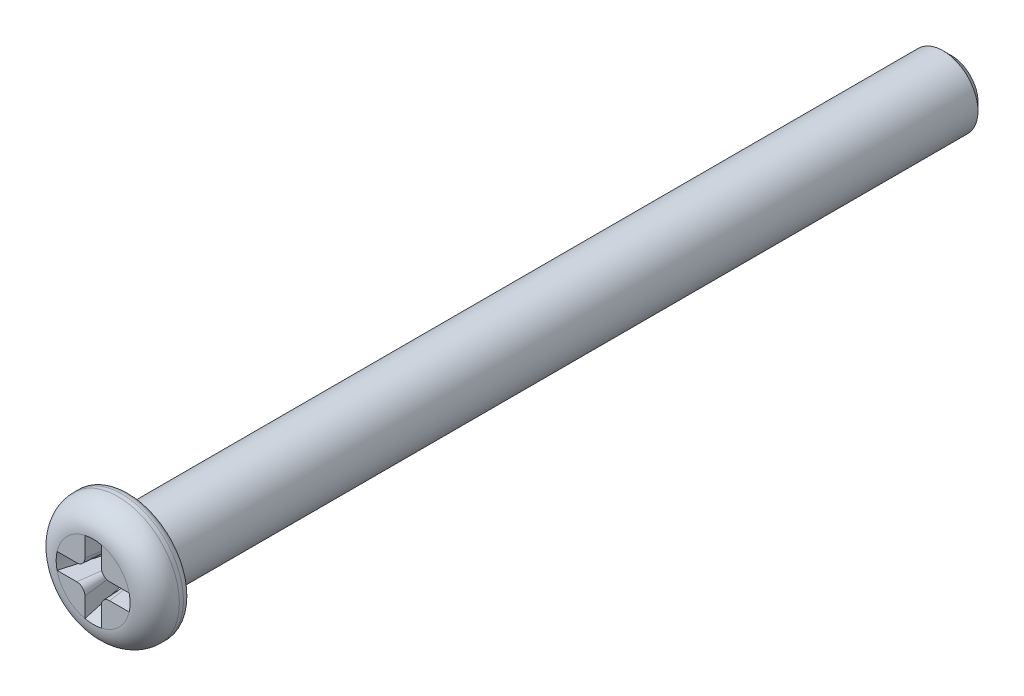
ISO-10303-21;
HEADER;
FILE_DESCRIPTION(('STEP AP214'),'2;1');
FILE_NAME('part.step','',(''),(''),'','','');
FILE_SCHEMA(('AUTOMOTIVE_DESIGN { 1 0 10303 214 1 1 1 1 }'));
ENDSEC;
DATA;
#1=APPLICATION_CONTEXT('core data for automotive mechanical design processes');
#2=APPLICATION_PROTOCOL_DEFINITION('international standard','automotive_design',2000,#1);
#3=PRODUCT_CONTEXT('',#1,'mechanical');
#4=PRODUCT('Part','Part','',(#3));
#5=PRODUCT_RELATED_PRODUCT_CATEGORY('part','',(#4));
#6=PRODUCT_DEFINITION_FORMATION('','',#4);
#7=PRODUCT_DEFINITION_CONTEXT('part definition',#1,'design');
#8=PRODUCT_DEFINITION('design','',#6,#7);
#9=PRODUCT_DEFINITION_SHAPE('','',#8);
#10=(LENGTH_UNIT() NAMED_UNIT(*) SI_UNIT(.MILLI.,.METRE.));
#11=(NAMED_UNIT(*) PLANE_ANGLE_UNIT() SI_UNIT($,.RADIAN.));
#12=(NAMED_UNIT(*) SI_UNIT($,.STERADIAN.) SOLID_ANGLE_UNIT());
#13=UNCERTAINTY_MEASURE_WITH_UNIT(LENGTH_MEASURE(1.E-05),#10,'distance_accuracy_value','');
#14=(GEOMETRIC_REPRESENTATION_CONTEXT(3) GLOBAL_UNCERTAINTY_ASSIGNED_CONTEXT((#13)) GLOBAL_UNIT_ASSIGNED_CONTEXT((#10,
#11,#12)) REPRESENTATION_CONTEXT('',''));
#15=CARTESIAN_POINT('',(0.,0.,0.));
#16=DIRECTION('',(0.,0.,1.));
#17=DIRECTION('',(1.,0.,0.));
#18=AXIS2_PLACEMENT_3D('',#15,#16,#17);
#19=CARTESIAN_POINT('',(40.6000000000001,6.39999999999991,4.9));
#20=DIRECTION('',(1.,0.,0.));
#21=DIRECTION('',(0.,1.,0.));
#22=AXIS2_PLACEMENT_3D('',#19,#20,#21);
#23=PLANE('',#22);
#24=DIRECTION('',(0.,1.,0.));
#25=VECTOR('',#24,1.);
#26=CARTESIAN_POINT('',(40.6000000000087,7.27598243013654,3.8));
#27=LINE('',#26,#25);
#28=CARTESIAN_POINT('',(40.6000000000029,6.45000003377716,3.80000024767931));
#29=VERTEX_POINT('',#28);
#30=CARTESIAN_POINT('',(40.6000000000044,6.77125711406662,3.79999999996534));
#31=VERTEX_POINT('',#30);
#32=EDGE_CURVE('E235',#29,#31,#27,.T.);
#33=ORIENTED_EDGE('',*,*,#32,.F.);
#34=CARTESIAN_POINT('',(40.5999999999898,6.59999999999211,4.89999999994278));
#35=CARTESIAN_POINT('',(40.6000000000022,6.59374999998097,4.85416666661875));
#36=CARTESIAN_POINT('',(40.5999999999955,6.58749999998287,4.80833333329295));
#37=CARTESIAN_POINT('',(40.599999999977,6.57499999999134,4.71666666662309));
#38=CARTESIAN_POINT('',(40.5999999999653,6.5687499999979,4.67083333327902));
#39=CARTESIAN_POINT('',(40.5999999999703,6.55625000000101,4.57916666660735));
#40=CARTESIAN_POINT('',(40.599999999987,6.54999999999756,4.53333333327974));
#41=CARTESIAN_POINT('',(40.5999999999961,6.53749999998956,4.44166666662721));
#42=CARTESIAN_POINT('',(40.5999999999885,6.53124999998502,4.39583333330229));
#43=CARTESIAN_POINT('',(40.5999999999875,6.51874999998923,4.30416666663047));
#44=CARTESIAN_POINT('',(40.5999999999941,6.51249999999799,4.25833333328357));
#45=CARTESIAN_POINT('',(40.5999999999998,6.49999999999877,4.16666666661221));
#46=CARTESIAN_POINT('',(40.5999999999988,6.49374999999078,4.12083333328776));
#47=CARTESIAN_POINT('',(40.5999999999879,6.48124999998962,4.02916666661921));
#48=CARTESIAN_POINT('',(40.5999999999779,6.47499999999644,3.98333333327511));
#49=CARTESIAN_POINT('',(40.599999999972,6.46250000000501,3.89166666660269));
#50=CARTESIAN_POINT('',(40.5999999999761,6.45625000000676,3.84583333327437));
#51=CARTESIAN_POINT('',(40.5999999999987,6.44999999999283,3.79999999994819));
#52=B_SPLINE_CURVE_WITH_KNOTS('',3,(#34,#35,#36,#37,#38,#39,#40,#41,#42,#43,#44,#45,#46,#47,#48,
#49,#50,#51),.UNSPECIFIED.,.F.,.F.,(4,2,2,2,2,2,2,2,4),(0.,0.138772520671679,0.277545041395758,
0.416317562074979,0.555090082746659,0.69386260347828,0.832635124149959,0.971407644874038,
1.11018016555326),.UNSPECIFIED.);
#53=CARTESIAN_POINT('',(40.5999999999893,6.59999999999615,4.89999999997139));
#54=VERTEX_POINT('',#53);
#55=EDGE_CURVE('E280',#54,#29,#52,.T.);
#56=ORIENTED_EDGE('',*,*,#55,.F.);
#57=DIRECTION('',(0.,1.,0.));
#58=VECTOR('',#57,1.);
#59=CARTESIAN_POINT('',(40.6000000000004,7.27598243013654,4.9));
#60=LINE('',#59,#58);
#61=CARTESIAN_POINT('',(40.6000000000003,7.077496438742,4.90000000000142));
#62=VERTEX_POINT('',#61);
#63=EDGE_CURVE('E234',#62,#54,#60,.F.);
#64=ORIENTED_EDGE('',*,*,#63,.F.);
#65=CARTESIAN_POINT('',(40.6000000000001,7.07749643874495,4.90000000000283));
#66=CARTESIAN_POINT('',(40.6000000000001,7.05227931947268,4.80824923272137));
#67=CARTESIAN_POINT('',(40.6000000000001,7.0270162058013,4.71651106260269));
#68=CARTESIAN_POINT('',(40.6000000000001,6.97635819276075,4.5330715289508));
#69=CARTESIAN_POINT('',(40.6000000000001,6.95096329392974,4.44137016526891));
#70=CARTESIAN_POINT('',(40.6000000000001,6.90000165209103,4.25801490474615));
#71=CARTESIAN_POINT('',(40.6000000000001,6.87443490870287,4.16636100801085));
#72=CARTESIAN_POINT('',(40.6000000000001,6.82305221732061,3.98312272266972));
#73=CARTESIAN_POINT('',(40.6000000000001,6.79723626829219,3.89153833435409));
#74=CARTESIAN_POINT('',(40.6000000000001,6.771257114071,3.79999999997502));
#75=B_SPLINE_CURVE_WITH_KNOTS('',3,(#65,#66,#67,#68,#69,#70,#71,#72,#73,#74),.UNSPECIFIED.,.F.,
.F.,(4,2,2,2,4),(0.,0.28545924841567,0.570917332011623,0.856376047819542,1.14183594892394),.UNSPECIFIED.);
#76=EDGE_CURVE('E226',#62,#31,#75,.T.);
#77=ORIENTED_EDGE('',*,*,#76,.T.);
#78=EDGE_LOOP('',(#33,#56,#64,#77));
#79=FACE_BOUND('',#78,.T.);
#80=ADVANCED_FACE('F17',(#79),#23,.F.);
#81=CARTESIAN_POINT('',(40.797300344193,6.59730034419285,4.88020252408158));
#82=DIRECTION('',(0.13389655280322,0.133896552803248,0.981908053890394));
#83=DIRECTION('',(0.,-0.990830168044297,0.135113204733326));
#84=AXIS2_PLACEMENT_3D('',#81,#82,#83);
#85=CONICAL_SURFACE('',#84,0.199093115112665,0.134299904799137);
#86=CARTESIAN_POINT('',(40.6509473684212,6.45094736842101,3.8));
#87=DIRECTION('',(0.,0.,1.));
#88=DIRECTION('',(0.707106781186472,0.707106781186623,0.));
#89=AXIS2_PLACEMENT_3D('',#86,#87,#88);
#90=ELLIPSE('',#89,0.0514188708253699,0.0504714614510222);
#91=CARTESIAN_POINT('',(40.6500000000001,6.40000000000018,3.8));
#92=VERTEX_POINT('',#91);
#93=EDGE_CURVE('E238',#92,#29,#90,.F.);
#94=ORIENTED_EDGE('',*,*,#93,.F.);
#95=DIRECTION('',(0.135113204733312,0.,0.990830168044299));
#96=VECTOR('',#95,1.);
#97=CARTESIAN_POINT('',(40.6500000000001,6.39999999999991,3.8));
#98=LINE('',#97,#96);
#99=CARTESIAN_POINT('',(40.8000000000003,6.39999999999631,4.9));
#100=VERTEX_POINT('',#99);
#101=EDGE_CURVE('E438',#92,#100,#98,.T.);
#102=ORIENTED_EDGE('',*,*,#101,.T.);
#103=CARTESIAN_POINT('',(40.8037894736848,6.60378947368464,4.9));
#104=DIRECTION('',(0.,0.,1.));
#105=DIRECTION('',(0.707106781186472,0.707106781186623,0.));
#106=AXIS2_PLACEMENT_3D('',#103,#104,#105);
#107=ELLIPSE('',#106,0.205675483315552,0.201885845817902);
#108=EDGE_CURVE('E236',#54,#100,#107,.T.);
#109=ORIENTED_EDGE('',*,*,#108,.F.);
#110=ORIENTED_EDGE('',*,*,#55,.T.);
#111=EDGE_LOOP('',(#94,#102,#109,#110));
#112=FACE_BOUND('',#111,.T.);
#113=ADVANCED_FACE('F244',(#112),#85,.T.);
#114=CARTESIAN_POINT('',(41.3,6.39999999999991,4.9));
#115=DIRECTION('',(0.,1.,0.));
#116=DIRECTION('',(-1.,0.,0.));
#117=AXIS2_PLACEMENT_3D('',#114,#115,#116);
#118=PLANE('',#117);
#119=CARTESIAN_POINT('',(40.9712571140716,6.39999999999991,3.79999999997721));
#120=CARTESIAN_POINT('',(41.0149832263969,6.39999999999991,3.95419388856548));
#121=CARTESIAN_POINT('',(41.0582983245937,6.39999999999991,4.10850313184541));
#122=CARTESIAN_POINT('',(41.1443563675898,6.39999999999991,4.41728034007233));
#123=CARTESIAN_POINT('',(41.1870993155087,6.39999999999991,4.57174830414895));
#124=CARTESIAN_POINT('',(41.245640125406,6.39999999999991,4.78416806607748));
#125=CARTESIAN_POINT('',(41.2615762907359,6.39999999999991,4.84208186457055));
#126=CARTESIAN_POINT('',(41.2774964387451,6.39999999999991,4.90000000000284));
#127=B_SPLINE_CURVE_WITH_KNOTS('',3,(#119,#120,#121,#122,#123,#124,#125,#126),.UNSPECIFIED.,.F.,
.F.,(4,2,2,4),(0.,0.480819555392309,0.961636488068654,1.14183555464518),.UNSPECIFIED.);
#128=CARTESIAN_POINT('',(40.9712571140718,6.39999999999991,3.79999999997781));
#129=VERTEX_POINT('',#128);
#130=CARTESIAN_POINT('',(41.2774964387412,6.40000000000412,4.90000000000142));
#131=VERTEX_POINT('',#130);
#132=EDGE_CURVE('E312',#129,#131,#127,.T.);
#133=ORIENTED_EDGE('',*,*,#132,.T.);
#134=DIRECTION('',(1.,0.,0.));
#135=VECTOR('',#134,1.);
#136=CARTESIAN_POINT('',(64.2944873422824,6.40000000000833,4.9));
#137=LINE('',#136,#135);
#138=EDGE_CURVE('E407',#100,#131,#137,.T.);
#139=ORIENTED_EDGE('',*,*,#138,.F.);
#140=ORIENTED_EDGE('',*,*,#101,.F.);
#141=DIRECTION('',(1.,0.,0.));
#142=VECTOR('',#141,1.);
#143=CARTESIAN_POINT('',(64.2944873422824,6.39999999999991,3.8));
#144=LINE('',#143,#142);
#145=EDGE_CURVE('E415',#129,#92,#144,.F.);
#146=ORIENTED_EDGE('',*,*,#145,.F.);
#147=EDGE_LOOP('',(#133,#139,#140,#146));
#148=FACE_BOUND('',#147,.T.);
#149=ADVANCED_FACE('F299',(#148),#118,.F.);
#150=CARTESIAN_POINT('',(40.6000000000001,5.99999999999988,4.9));
#151=DIRECTION('',(0.,-1.,0.));
#152=DIRECTION('',(1.,0.,0.));
#153=AXIS2_PLACEMENT_3D('',#150,#151,#152);
#154=PLANE('',#153);
#155=DIRECTION('',(1.,0.,0.));
#156=VECTOR('',#155,1.);
#157=CARTESIAN_POINT('',(64.2944873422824,5.99999999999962,4.9));
#158=LINE('',#157,#156);
#159=CARTESIAN_POINT('',(41.2774964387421,5.99999999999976,4.90000000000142));
#160=VERTEX_POINT('',#159);
#161=CARTESIAN_POINT('',(40.7999999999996,6.00000000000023,4.8999999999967));
#162=VERTEX_POINT('',#161);
#163=EDGE_CURVE('E311',#160,#162,#158,.F.);
#164=ORIENTED_EDGE('',*,*,#163,.F.);
#165=CARTESIAN_POINT('',(41.2774964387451,5.99999999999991,4.90000000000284));
#166=CARTESIAN_POINT('',(41.2522793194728,5.99999999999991,4.80824923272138));
#167=CARTESIAN_POINT('',(41.2270162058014,5.99999999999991,4.7165110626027));
#168=CARTESIAN_POINT('',(41.1763581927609,5.99999999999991,4.5330715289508));
#169=CARTESIAN_POINT('',(41.1509632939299,5.99999999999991,4.44137016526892));
#170=CARTESIAN_POINT('',(41.1000016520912,5.9999999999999,4.25801490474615));
#171=CARTESIAN_POINT('',(41.074434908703,5.9999999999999,4.16636100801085));
#172=CARTESIAN_POINT('',(41.0230522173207,5.9999999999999,3.98312272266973));
#173=CARTESIAN_POINT('',(40.9972362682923,5.9999999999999,3.8915383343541));
#174=CARTESIAN_POINT('',(40.9712571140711,5.9999999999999,3.79999999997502));
#175=B_SPLINE_CURVE_WITH_KNOTS('',3,(#165,#166,#167,#168,#169,#170,#171,#172,#173,#174),
.UNSPECIFIED.,.F.,.F.,(4,2,2,2,4),(0.,0.28545924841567,0.570917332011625,0.856376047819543,
1.14183594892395),.UNSPECIFIED.);
#176=CARTESIAN_POINT('',(40.9712571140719,6.00000000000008,3.79999999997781));
#177=VERTEX_POINT('',#176);
#178=EDGE_CURVE('E303',#160,#177,#175,.T.);
#179=ORIENTED_EDGE('',*,*,#178,.T.);
#180=DIRECTION('',(1.,0.,0.));
#181=VECTOR('',#180,1.);
#182=CARTESIAN_POINT('',(64.2944873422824,6.00000000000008,3.8));
#183=LINE('',#182,#181);
#184=CARTESIAN_POINT('',(40.6500000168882,6.00000000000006,3.80000012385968));
#185=VERTEX_POINT('',#184);
#186=EDGE_CURVE('E278',#185,#177,#183,.T.);
#187=ORIENTED_EDGE('',*,*,#186,.F.);
#188=CARTESIAN_POINT('',(40.7999999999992,6.00000000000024,4.8999999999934));
#189=CARTESIAN_POINT('',(40.7937500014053,6.00000000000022,4.85416667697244));
#190=CARTESIAN_POINT('',(40.7875000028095,6.00000000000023,4.80833335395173));
#191=CARTESIAN_POINT('',(40.7750000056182,6.00000000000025,4.71666670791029));
#192=CARTESIAN_POINT('',(40.7687500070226,6.00000000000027,4.67083338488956));
#193=CARTESIAN_POINT('',(40.7562500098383,6.00000000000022,4.57916673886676));
#194=CARTESIAN_POINT('',(40.7500000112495,6.00000000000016,4.5333334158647));
#195=CARTESIAN_POINT('',(40.7375000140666,6.00000000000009,4.44166676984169));
#196=CARTESIAN_POINT('',(40.7312500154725,6.00000000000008,4.39583344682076));
#197=CARTESIAN_POINT('',(40.7187500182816,6.00000000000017,4.30416680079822));
#198=CARTESIAN_POINT('',(40.7125000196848,6.00000000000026,4.25833347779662));
#199=CARTESIAN_POINT('',(40.7000000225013,6.00000000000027,4.16666683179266));
#200=CARTESIAN_POINT('',(40.6937500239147,6.00000000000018,4.1208335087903));
#201=CARTESIAN_POINT('',(40.6812500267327,6.00000000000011,4.02916686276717));
#202=CARTESIAN_POINT('',(40.6750000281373,6.00000000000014,3.98333353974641));
#203=CARTESIAN_POINT('',(40.6625000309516,6.00000000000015,3.8916668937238));
#204=CARTESIAN_POINT('',(40.6562500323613,6.00000000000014,3.84583357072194));
#205=CARTESIAN_POINT('',(40.6500000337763,6.00000000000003,3.80000024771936));
#206=B_SPLINE_CURVE_WITH_KNOTS('',3,(#188,#189,#190,#191,#192,#193,#194,#195,#196,#197,#198,
#199,#200,#201,#202,#203,#204,#205),.UNSPECIFIED.,.F.,.F.,(4,2,2,2,2,2,2,2,4),(0.,
0.138772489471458,0.277544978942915,0.416317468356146,0.555089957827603,0.693862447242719,
0.832634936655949,0.971407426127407,1.11017991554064),.UNSPECIFIED.);
#207=EDGE_CURVE('E435',#162,#185,#206,.T.);
#208=ORIENTED_EDGE('',*,*,#207,.F.);
#209=EDGE_LOOP('',(#164,#179,#187,#208));
#210=FACE_BOUND('',#209,.T.);
#211=ADVANCED_FACE('F294',(#210),#154,.F.);
#212=CARTESIAN_POINT('',(40.7973003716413,5.80269962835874,4.8802027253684));
#213=DIRECTION('',(0.133896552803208,-0.133896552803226,0.981908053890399));
#214=DIRECTION('',(0.,-0.9908301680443,-0.135113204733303));
#215=AXIS2_PLACEMENT_3D('',#212,#213,#214);
#216=CONICAL_SURFACE('',#215,0.199093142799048,0.13429990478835);
#217=DIRECTION('',(0.,-0.135113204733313,0.990830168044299));
#218=VECTOR('',#217,1.);
#219=CARTESIAN_POINT('',(40.6000000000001,5.94999999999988,3.8));
#220=LINE('',#219,#218);
#221=CARTESIAN_POINT('',(40.5999999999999,5.94999999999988,3.8));
#222=VERTEX_POINT('',#221);
#223=CARTESIAN_POINT('',(40.5999999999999,5.79999999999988,4.9));
#224=VERTEX_POINT('',#223);
#225=EDGE_CURVE('E432',#222,#224,#220,.T.);
#226=ORIENTED_EDGE('',*,*,#225,.T.);
#227=CARTESIAN_POINT('',(40.8037894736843,5.79621052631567,4.9));
#228=DIRECTION('',(0.,0.,1.));
#229=DIRECTION('',(0.7071067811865,-0.707106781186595,0.));
#230=AXIS2_PLACEMENT_3D('',#227,#228,#229);
#231=ELLIPSE('',#230,0.205675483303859,0.201885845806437);
#232=EDGE_CURVE('E313',#162,#224,#231,.T.);
#233=ORIENTED_EDGE('',*,*,#232,.F.);
#234=ORIENTED_EDGE('',*,*,#207,.T.);
#235=CARTESIAN_POINT('',(40.6500000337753,6.00000000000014,3.8));
#236=CARTESIAN_POINT('',(40.6499619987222,6.00000000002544,3.80000004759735));
#237=CARTESIAN_POINT('',(40.6499239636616,5.99999995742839,3.8000000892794));
#238=CARTESIAN_POINT('',(40.6498478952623,5.99999978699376,3.800000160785));
#239=CARTESIAN_POINT('',(40.6498098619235,5.99999965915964,3.80000019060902));
#240=CARTESIAN_POINT('',(40.6497337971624,5.99999931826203,3.80000023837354));
#241=CARTESIAN_POINT('',(40.6496957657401,5.99999910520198,3.80000025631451));
#242=CARTESIAN_POINT('',(40.6496197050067,5.9999985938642,3.80000028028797));
#243=CARTESIAN_POINT('',(40.6495816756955,5.99999829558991,3.80000028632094));
#244=CARTESIAN_POINT('',(40.6495056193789,5.99999761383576,3.8000002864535));
#245=CARTESIAN_POINT('',(40.6494675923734,5.99999723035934,3.80000028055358));
#246=CARTESIAN_POINT('',(40.6493915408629,5.99999637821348,3.80000025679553));
#247=CARTESIAN_POINT('',(40.6493535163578,5.99999590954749,3.8000002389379));
#248=CARTESIAN_POINT('',(40.6492774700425,5.99999488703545,3.80000019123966));
#249=CARTESIAN_POINT('',(40.6492394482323,5.99999433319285,3.80000016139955));
#250=CARTESIAN_POINT('',(40.6491634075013,5.99999314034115,3.80000008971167));
#251=CARTESIAN_POINT('',(40.6491253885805,5.99999250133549,3.8000000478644));
#252=CARTESIAN_POINT('',(40.6490873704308,5.99999181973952,3.8));
#253=B_SPLINE_CURVE_WITH_KNOTS('',3,(#235,#236,#237,#238,#239,#240,#241,#242,#243,#244,#245,
#246,#247,#248,#249,#250,#251,#252),.UNSPECIFIED.,.F.,.F.,(4,2,2,2,2,2,2,2,4),(0.,
0.000114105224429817,0.000228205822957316,0.000342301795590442,0.000456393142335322,
0.000570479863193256,0.00068456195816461,0.000798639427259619,0.000912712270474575),.UNSPECIFIED.);
#254=CARTESIAN_POINT('',(40.6490873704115,5.99999181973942,3.79999999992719));
#255=VERTEX_POINT('',#254);
#256=EDGE_CURVE('E268',#255,#185,#253,.F.);
#257=ORIENTED_EDGE('',*,*,#256,.F.);
#258=CARTESIAN_POINT('',(40.6509473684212,5.94905263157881,3.8));
#259=DIRECTION('',(0.,0.,1.));
#260=DIRECTION('',(0.7071067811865,-0.707106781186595,0.));
#261=AXIS2_PLACEMENT_3D('',#258,#259,#260);
#262=ELLIPSE('',#261,0.0514188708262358,0.0504714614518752);
#263=EDGE_CURVE('E279',#222,#255,#262,.F.);
#264=ORIENTED_EDGE('',*,*,#263,.F.);
#265=EDGE_LOOP('',(#226,#233,#234,#257,#264));
#266=FACE_BOUND('',#265,.T.);
#267=ADVANCED_FACE('F298',(#266),#216,.T.);
#268=CARTESIAN_POINT('',(40.6000000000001,5.29999999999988,4.9));
#269=DIRECTION('',(1.,0.,0.));
#270=DIRECTION('',(0.,1.,0.));
#271=AXIS2_PLACEMENT_3D('',#268,#269,#270);
#272=PLANE('',#271);
#273=DIRECTION('',(0.,1.,0.));
#274=VECTOR('',#273,1.);
#275=CARTESIAN_POINT('',(40.6,7.27598243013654,4.9));
#276=LINE('',#275,#274);
#277=CARTESIAN_POINT('',(40.6000000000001,5.32250356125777,4.90000000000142));
#278=VERTEX_POINT('',#277);
#279=EDGE_CURVE('E399',#224,#278,#276,.F.);
#280=ORIENTED_EDGE('',*,*,#279,.F.);
#281=ORIENTED_EDGE('',*,*,#225,.F.);
#282=DIRECTION('',(0.,1.,0.));
#283=VECTOR('',#282,1.);
#284=CARTESIAN_POINT('',(40.6000000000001,7.27598243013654,3.8));
#285=LINE('',#284,#283);
#286=CARTESIAN_POINT('',(40.6000000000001,5.62874288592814,3.79999999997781));
#287=VERTEX_POINT('',#286);
#288=EDGE_CURVE('E419',#287,#222,#285,.T.);
#289=ORIENTED_EDGE('',*,*,#288,.F.);
#290=CARTESIAN_POINT('',(40.6000000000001,5.62874288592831,3.79999999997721));
#291=CARTESIAN_POINT('',(40.6000000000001,5.58501677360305,3.95419388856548));
#292=CARTESIAN_POINT('',(40.6000000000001,5.54170167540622,4.10850313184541));
#293=CARTESIAN_POINT('',(40.6000000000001,5.45564363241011,4.41728034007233));
#294=CARTESIAN_POINT('',(40.6000000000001,5.41290068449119,4.57174830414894));
#295=CARTESIAN_POINT('',(40.6000000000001,5.3543598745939,4.78416806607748));
#296=CARTESIAN_POINT('',(40.6000000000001,5.33842370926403,4.84208186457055));
#297=CARTESIAN_POINT('',(40.6000000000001,5.32250356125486,4.90000000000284));
#298=B_SPLINE_CURVE_WITH_KNOTS('',3,(#290,#291,#292,#293,#294,#295,#296,#297),.UNSPECIFIED.,.F.,
.F.,(4,2,2,4),(0.,0.480819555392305,0.961636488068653,1.14183555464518),.UNSPECIFIED.);
#299=EDGE_CURVE('E402',#287,#278,#298,.T.);
#300=ORIENTED_EDGE('',*,*,#299,.T.);
#301=EDGE_LOOP('',(#280,#281,#289,#300));
#302=FACE_BOUND('',#301,.T.);
#303=ADVANCED_FACE('F487',(#302),#272,.F.);
#304=CARTESIAN_POINT('',(40.2000000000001,5.99999999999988,4.9));
#305=DIRECTION('',(-1.,0.,0.));
#306=DIRECTION('',(0.,-1.,0.));
#307=AXIS2_PLACEMENT_3D('',#304,#305,#306);
#308=PLANE('',#307);
#309=DIRECTION('',(0.,1.,0.));
#310=VECTOR('',#309,1.);
#311=CARTESIAN_POINT('',(40.2000000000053,7.27598243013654,3.8));
#312=LINE('',#311,#310);
#313=CARTESIAN_POINT('',(40.1999999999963,5.94999996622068,3.8000002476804));
#314=VERTEX_POINT('',#313);
#315=CARTESIAN_POINT('',(40.2000000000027,5.6287428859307,3.79999999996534));
#316=VERTEX_POINT('',#315);
#317=EDGE_CURVE('E422',#314,#316,#312,.F.);
#318=ORIENTED_EDGE('',*,*,#317,.F.);
#319=CARTESIAN_POINT('',(40.1999999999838,5.80000000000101,4.89999999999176));
#320=CARTESIAN_POINT('',(40.1999999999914,5.80625000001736,4.85416666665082));
#321=CARTESIAN_POINT('',(40.1999999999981,5.81250000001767,4.80833333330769));
#322=CARTESIAN_POINT('',(40.2000000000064,5.82500000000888,4.71666666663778));
#323=CARTESIAN_POINT('',(40.200000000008,5.83124999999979,4.670833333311));
#324=CARTESIAN_POINT('',(40.2000000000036,5.8437500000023,4.5791666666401));
#325=CARTESIAN_POINT('',(40.1999999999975,5.8500000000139,4.53333333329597));
#326=CARTESIAN_POINT('',(40.1999999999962,5.86250000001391,4.44166666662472));
#327=CARTESIAN_POINT('',(40.200000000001,5.86875000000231,4.3958333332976));
#328=CARTESIAN_POINT('',(40.1999999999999,5.88125000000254,4.30416666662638));
#329=CARTESIAN_POINT('',(40.1999999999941,5.88750000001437,4.25833333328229));
#330=CARTESIAN_POINT('',(40.1999999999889,5.90000000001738,4.16666666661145));
#331=CARTESIAN_POINT('',(40.1999999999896,5.90625000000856,4.12083333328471));
#332=CARTESIAN_POINT('',(40.2000000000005,5.91875000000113,4.02916666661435));
#333=CARTESIAN_POINT('',(40.2000000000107,5.92500000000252,3.98333333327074));
#334=CARTESIAN_POINT('',(40.2000000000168,5.93750000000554,3.8916666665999));
#335=CARTESIAN_POINT('',(40.2000000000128,5.94375000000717,3.84583333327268));
#336=CARTESIAN_POINT('',(40.1999999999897,5.95000000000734,3.79999999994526));
#337=B_SPLINE_CURVE_WITH_KNOTS('',3,(#319,#320,#321,#322,#323,#324,#325,#326,#327,#328,#329,
#330,#331,#332,#333,#334,#335,#336),.UNSPECIFIED.,.F.,.F.,(4,2,2,2,2,2,2,2,4),(0.,
0.13877252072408,0.277545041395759,0.416317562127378,0.555090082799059,0.69386260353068,
0.83263512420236,0.971407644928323,1.11018016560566),.UNSPECIFIED.);
#338=CARTESIAN_POINT('',(40.1999999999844,5.8000000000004,4.89999999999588));
#339=VERTEX_POINT('',#338);
#340=EDGE_CURVE('E467',#339,#314,#337,.T.);
#341=ORIENTED_EDGE('',*,*,#340,.F.);
#342=DIRECTION('',(0.,1.,0.));
#343=VECTOR('',#342,1.);
#344=CARTESIAN_POINT('',(40.1999999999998,7.27598243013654,4.9));
#345=LINE('',#344,#343);
#346=CARTESIAN_POINT('',(40.2,5.32250356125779,4.90000000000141));
#347=VERTEX_POINT('',#346);
#348=EDGE_CURVE('E391',#347,#339,#345,.T.);
#349=ORIENTED_EDGE('',*,*,#348,.F.);
#350=CARTESIAN_POINT('',(40.2000000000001,5.32250356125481,4.90000000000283));
#351=CARTESIAN_POINT('',(40.2000000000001,5.34772068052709,4.80824923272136));
#352=CARTESIAN_POINT('',(40.2000000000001,5.37298379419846,4.71651106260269));
#353=CARTESIAN_POINT('',(40.2000000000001,5.42364180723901,4.53307152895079));
#354=CARTESIAN_POINT('',(40.2000000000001,5.44903670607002,4.44137016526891));
#355=CARTESIAN_POINT('',(40.2000000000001,5.49999834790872,4.25801490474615));
#356=CARTESIAN_POINT('',(40.2000000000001,5.52556509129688,4.16636100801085));
#357=CARTESIAN_POINT('',(40.2000000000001,5.57694778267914,3.98312272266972));
#358=CARTESIAN_POINT('',(40.2000000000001,5.60276373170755,3.89153833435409));
#359=CARTESIAN_POINT('',(40.2000000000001,5.62874288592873,3.79999999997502));
#360=B_SPLINE_CURVE_WITH_KNOTS('',3,(#350,#351,#352,#353,#354,#355,#356,#357,#358,#359),
.UNSPECIFIED.,.F.,.F.,(4,2,2,2,4),(0.,0.285459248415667,0.570917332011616,0.856376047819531,
1.14183594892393),.UNSPECIFIED.);
#361=EDGE_CURVE('E491',#347,#316,#360,.T.);
#362=ORIENTED_EDGE('',*,*,#361,.T.);
#363=EDGE_LOOP('',(#318,#341,#349,#362));
#364=FACE_BOUND('',#363,.T.);
#365=ADVANCED_FACE('F482',(#364),#308,.F.);
#366=CARTESIAN_POINT('',(40.0026996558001,5.8026996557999,4.88020252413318));
#367=DIRECTION('',(-0.133896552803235,-0.133896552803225,0.981908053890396));
#368=DIRECTION('',(0.990830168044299,0.,0.135113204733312));
#369=AXIS2_PLACEMENT_3D('',#366,#367,#368);
#370=CONICAL_SURFACE('',#369,0.199093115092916,0.134299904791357);
#371=CARTESIAN_POINT('',(40.1490526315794,5.94905263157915,3.8));
#372=DIRECTION('',(0.,0.,1.));
#373=DIRECTION('',(-0.707106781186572,-0.707106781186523,0.));
#374=AXIS2_PLACEMENT_3D('',#371,#372,#373);
#375=ELLIPSE('',#374,0.0514188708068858,0.0504714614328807);
#376=CARTESIAN_POINT('',(40.1500000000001,5.99999999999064,3.8));
#377=VERTEX_POINT('',#376);
#378=EDGE_CURVE('E424',#377,#314,#375,.F.);
#379=ORIENTED_EDGE('',*,*,#378,.F.);
#380=DIRECTION('',(-0.135113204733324,0.,0.990830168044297));
#381=VECTOR('',#380,1.);
#382=CARTESIAN_POINT('',(40.1500000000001,5.99999999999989,3.8));
#383=LINE('',#382,#381);
#384=CARTESIAN_POINT('',(40.0000000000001,5.99999999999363,4.9));
#385=VERTEX_POINT('',#384);
#386=EDGE_CURVE('E142',#377,#385,#383,.T.);
#387=ORIENTED_EDGE('',*,*,#386,.T.);
#388=CARTESIAN_POINT('',(39.9962105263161,5.79621052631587,4.9));
#389=DIRECTION('',(0.,0.,1.));
#390=DIRECTION('',(-0.707106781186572,-0.707106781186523,0.));
#391=AXIS2_PLACEMENT_3D('',#388,#389,#390);
#392=ELLIPSE('',#391,0.20567548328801,0.201885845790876);
#393=EDGE_CURVE('E189',#339,#385,#392,.T.);
#394=ORIENTED_EDGE('',*,*,#393,.F.);
#395=ORIENTED_EDGE('',*,*,#340,.T.);
#396=EDGE_LOOP('',(#379,#387,#394,#395));
#397=FACE_BOUND('',#396,.T.);
#398=ADVANCED_FACE('F479',(#397),#370,.T.);
#399=CARTESIAN_POINT('',(39.5000000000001,5.99999999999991,4.9));
#400=DIRECTION('',(0.,-1.,0.));
#401=DIRECTION('',(1.,0.,0.));
#402=AXIS2_PLACEMENT_3D('',#399,#400,#401);
#403=PLANE('',#402);
#404=CARTESIAN_POINT('',(39.8287428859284,5.9999999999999,3.79999999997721));
#405=CARTESIAN_POINT('',(39.7850167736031,5.9999999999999,3.95419388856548));
#406=CARTESIAN_POINT('',(39.7417016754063,5.9999999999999,4.10850313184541));
#407=CARTESIAN_POINT('',(39.6556436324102,5.99999999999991,4.41728034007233));
#408=CARTESIAN_POINT('',(39.6129006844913,5.99999999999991,4.57174830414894));
#409=CARTESIAN_POINT('',(39.554359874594,5.99999999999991,4.78416806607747));
#410=CARTESIAN_POINT('',(39.5384237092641,5.99999999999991,4.84208186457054));
#411=CARTESIAN_POINT('',(39.5225035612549,5.99999999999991,4.90000000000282));
#412=B_SPLINE_CURVE_WITH_KNOTS('',3,(#404,#405,#406,#407,#408,#409,#410,#411),.UNSPECIFIED.,.F.,
.F.,(4,2,2,4),(0.,0.480819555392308,0.961636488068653,1.14183555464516),.UNSPECIFIED.);
#413=CARTESIAN_POINT('',(39.8287428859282,5.9999999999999,3.79999999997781));
#414=VERTEX_POINT('',#413);
#415=CARTESIAN_POINT('',(39.5225035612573,6.00000000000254,4.90000000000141));
#416=VERTEX_POINT('',#415);
#417=EDGE_CURVE('E202',#414,#416,#412,.T.);
#418=ORIENTED_EDGE('',*,*,#417,.T.);
#419=DIRECTION('',(1.,0.,0.));
#420=VECTOR('',#419,1.);
#421=CARTESIAN_POINT('',(64.2944873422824,6.00000000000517,4.9));
#422=LINE('',#421,#420);
#423=EDGE_CURVE('E187',#385,#416,#422,.F.);
#424=ORIENTED_EDGE('',*,*,#423,.F.);
#425=ORIENTED_EDGE('',*,*,#386,.F.);
#426=DIRECTION('',(1.,0.,0.));
#427=VECTOR('',#426,1.);
#428=CARTESIAN_POINT('',(64.2944873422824,5.99999999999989,3.8));
#429=LINE('',#428,#427);
#430=EDGE_CURVE('E152',#414,#377,#429,.T.);
#431=ORIENTED_EDGE('',*,*,#430,.F.);
#432=EDGE_LOOP('',(#418,#424,#425,#431));
#433=FACE_BOUND('',#432,.T.);
#434=ADVANCED_FACE('F176',(#433),#403,.F.);
#435=CARTESIAN_POINT('',(40.2000000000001,6.39999999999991,4.9));
#436=DIRECTION('',(0.,1.,0.));
#437=DIRECTION('',(-1.,0.,0.));
#438=AXIS2_PLACEMENT_3D('',#435,#436,#437);
#439=PLANE('',#438);
#440=DIRECTION('',(1.,0.,0.));
#441=VECTOR('',#440,1.);
#442=CARTESIAN_POINT('',(64.2944873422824,6.40000000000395,3.8));
#443=LINE('',#442,#441);
#444=CARTESIAN_POINT('',(40.1499999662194,6.40000000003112,3.80000024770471));
#445=VERTEX_POINT('',#444);
#446=CARTESIAN_POINT('',(39.8287428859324,6.40000000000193,3.79999999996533));
#447=VERTEX_POINT('',#446);
#448=EDGE_CURVE('E145',#445,#447,#443,.F.);
#449=ORIENTED_EDGE('',*,*,#448,.F.);
#450=CARTESIAN_POINT('',(39.9999999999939,6.40000000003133,4.9000000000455));
#451=CARTESIAN_POINT('',(40.0062499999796,6.40000000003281,4.85416666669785));
#452=CARTESIAN_POINT('',(40.0124999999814,6.4000000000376,4.80833333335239));
#453=CARTESIAN_POINT('',(40.0249999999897,6.40000000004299,4.71666666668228));
#454=CARTESIAN_POINT('',(40.0312499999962,6.4000000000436,4.67083333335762));
#455=CARTESIAN_POINT('',(40.0437499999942,6.40000000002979,4.57916666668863));
#456=CARTESIAN_POINT('',(40.0499999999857,6.40000000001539,4.5333333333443));
#457=CARTESIAN_POINT('',(40.0624999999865,6.40000000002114,4.44166666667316));
#458=CARTESIAN_POINT('',(40.0687499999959,6.4000000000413,4.39583333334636));
#459=CARTESIAN_POINT('',(40.0812499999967,6.40000000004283,4.30416666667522));
#460=CARTESIAN_POINT('',(40.0874999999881,6.4000000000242,4.25833333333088));
#461=CARTESIAN_POINT('',(40.0999999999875,6.40000000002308,4.16666666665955));
#462=CARTESIAN_POINT('',(40.1062499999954,6.40000000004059,4.12083333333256));
#463=CARTESIAN_POINT('',(40.1187499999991,6.40000000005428,4.02916666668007));
#464=CARTESIAN_POINT('',(40.1249999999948,6.40000000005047,3.98333333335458));
#465=CARTESIAN_POINT('',(40.137499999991,6.40000000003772,3.89166666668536));
#466=CARTESIAN_POINT('',(40.1437499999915,6.40000000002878,3.84583333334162));
#467=CARTESIAN_POINT('',(40.1500000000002,6.4000000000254,3.799999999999));
#468=B_SPLINE_CURVE_WITH_KNOTS('',3,(#450,#451,#452,#453,#454,#455,#456,#457,#458,#459,#460,
#461,#462,#463,#464,#465,#466,#467),.UNSPECIFIED.,.F.,.F.,(4,2,2,2,2,2,2,2,4),(0.,
0.138772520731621,0.277545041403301,0.416317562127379,0.555090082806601,0.693862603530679,
0.8326351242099,0.971407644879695,1.11018016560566),.UNSPECIFIED.);
#469=CARTESIAN_POINT('',(39.999999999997,6.40000000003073,4.90000000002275));
#470=VERTEX_POINT('',#469);
#471=EDGE_CURVE('E133',#470,#445,#468,.T.);
#472=ORIENTED_EDGE('',*,*,#471,.F.);
#473=DIRECTION('',(1.,0.,0.));
#474=VECTOR('',#473,1.);
#475=CARTESIAN_POINT('',(64.2944873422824,6.4000000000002,4.9));
#476=LINE('',#475,#474);
#477=CARTESIAN_POINT('',(39.5225035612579,6.40000000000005,4.90000000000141));
#478=VERTEX_POINT('',#477);
#479=EDGE_CURVE('E209',#478,#470,#476,.T.);
#480=ORIENTED_EDGE('',*,*,#479,.F.);
#481=CARTESIAN_POINT('',(39.5225035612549,6.39999999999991,4.90000000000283));
#482=CARTESIAN_POINT('',(39.5477206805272,6.39999999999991,4.80824923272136));
#483=CARTESIAN_POINT('',(39.5729837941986,6.39999999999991,4.71651106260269));
#484=CARTESIAN_POINT('',(39.6236418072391,6.39999999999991,4.53307152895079));
#485=CARTESIAN_POINT('',(39.6490367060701,6.39999999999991,4.44137016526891));
#486=CARTESIAN_POINT('',(39.6999983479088,6.39999999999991,4.25801490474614));
#487=CARTESIAN_POINT('',(39.725565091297,6.39999999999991,4.16636100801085));
#488=CARTESIAN_POINT('',(39.7769477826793,6.39999999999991,3.98312272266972));
#489=CARTESIAN_POINT('',(39.8027637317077,6.39999999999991,3.89153833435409));
#490=CARTESIAN_POINT('',(39.8287428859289,6.39999999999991,3.79999999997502));
#491=B_SPLINE_CURVE_WITH_KNOTS('',3,(#481,#482,#483,#484,#485,#486,#487,#488,#489,#490),
.UNSPECIFIED.,.F.,.F.,(4,2,2,2,4),(0.,0.285459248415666,0.570917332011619,0.856376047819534,
1.14183594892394),.UNSPECIFIED.);
#492=EDGE_CURVE('E148',#478,#447,#491,.T.);
#493=ORIENTED_EDGE('',*,*,#492,.T.);
#494=EDGE_LOOP('',(#449,#472,#480,#493));
#495=FACE_BOUND('',#494,.T.);
#496=ADVANCED_FACE('F146',(#495),#439,.F.);
#497=CARTESIAN_POINT('',(40.0026996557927,6.59730034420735,4.88020252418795));
#498=DIRECTION('',(-0.133896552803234,0.133896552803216,0.981908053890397));
#499=DIRECTION('',(0.990830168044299,0.,0.135113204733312));
#500=AXIS2_PLACEMENT_3D('',#497,#498,#499);
#501=CONICAL_SURFACE('',#500,0.199093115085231,0.134299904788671);
#502=CARTESIAN_POINT('',(40.1490526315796,6.4509473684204,3.8));
#503=DIRECTION('',(0.,0.,1.));
#504=DIRECTION('',(-0.707106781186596,0.707106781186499,0.));
#505=AXIS2_PLACEMENT_3D('',#502,#503,#504);
#506=ELLIPSE('',#505,0.0514188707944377,0.0504714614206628);
#507=CARTESIAN_POINT('',(40.1999999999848,6.44999999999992,3.8));
#508=VERTEX_POINT('',#507);
#509=EDGE_CURVE('E21',#508,#445,#506,.F.);
#510=ORIENTED_EDGE('',*,*,#509,.F.);
#511=DIRECTION('',(0.,0.135113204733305,0.9908301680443));
#512=VECTOR('',#511,1.);
#513=CARTESIAN_POINT('',(40.2000000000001,6.44999999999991,3.8));
#514=LINE('',#513,#512);
#515=CARTESIAN_POINT('',(40.199999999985,6.59999999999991,4.9));
#516=VERTEX_POINT('',#515);
#517=EDGE_CURVE('E128',#508,#516,#514,.T.);
#518=ORIENTED_EDGE('',*,*,#517,.T.);
#519=CARTESIAN_POINT('',(39.9962105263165,6.60378947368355,4.9));
#520=DIRECTION('',(0.,0.,1.));
#521=DIRECTION('',(-0.707106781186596,0.707106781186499,0.));
#522=AXIS2_PLACEMENT_3D('',#519,#520,#521);
#523=ELLIPSE('',#522,0.205675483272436,0.201885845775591);
#524=EDGE_CURVE('E139',#470,#516,#523,.T.);
#525=ORIENTED_EDGE('',*,*,#524,.F.);
#526=ORIENTED_EDGE('',*,*,#471,.T.);
#527=EDGE_LOOP('',(#510,#518,#525,#526));
#528=FACE_BOUND('',#527,.T.);
#529=ADVANCED_FACE('F135',(#528),#501,.T.);
#530=CARTESIAN_POINT('',(40.2000000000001,7.09999999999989,4.9));
#531=DIRECTION('',(-1.,0.,0.));
#532=DIRECTION('',(0.,-1.,0.));
#533=AXIS2_PLACEMENT_3D('',#530,#531,#532);
#534=PLANE('',#533);
#535=CARTESIAN_POINT('',(40.2000000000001,6.77125711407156,3.79999999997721));
#536=CARTESIAN_POINT('',(40.2000000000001,6.81498322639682,3.95419388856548));
#537=CARTESIAN_POINT('',(40.2000000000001,6.85829832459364,4.10850313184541));
#538=CARTESIAN_POINT('',(40.2000000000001,6.94435636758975,4.41728034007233));
#539=CARTESIAN_POINT('',(40.2000000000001,6.98709931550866,4.57174830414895));
#540=CARTESIAN_POINT('',(40.2000000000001,7.04564012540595,4.78416806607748));
#541=CARTESIAN_POINT('',(40.2000000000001,7.06157629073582,4.84208186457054));
#542=CARTESIAN_POINT('',(40.2000000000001,7.07749643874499,4.90000000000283));
#543=B_SPLINE_CURVE_WITH_KNOTS('',3,(#535,#536,#537,#538,#539,#540,#541,#542),.UNSPECIFIED.,.F.,
.F.,(4,2,2,4),(0.,0.480819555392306,0.961636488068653,1.14183555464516),.UNSPECIFIED.);
#544=CARTESIAN_POINT('',(40.2000000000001,6.77125711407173,3.79999999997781));
#545=VERTEX_POINT('',#544);
#546=CARTESIAN_POINT('',(40.1999999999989,7.07749643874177,4.90000000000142));
#547=VERTEX_POINT('',#546);
#548=EDGE_CURVE('E36',#545,#547,#543,.T.);
#549=ORIENTED_EDGE('',*,*,#548,.T.);
#550=DIRECTION('',(0.,1.,0.));
#551=VECTOR('',#550,1.);
#552=CARTESIAN_POINT('',(40.1999999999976,7.27598243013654,4.9));
#553=LINE('',#552,#551);
#554=EDGE_CURVE('E207',#516,#547,#553,.T.);
#555=ORIENTED_EDGE('',*,*,#554,.F.);
#556=ORIENTED_EDGE('',*,*,#517,.F.);
#557=DIRECTION('',(0.,1.,0.));
#558=VECTOR('',#557,1.);
#559=CARTESIAN_POINT('',(40.2000000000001,7.27598243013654,3.8));
#560=LINE('',#559,#558);
#561=EDGE_CURVE('E157',#545,#508,#560,.F.);
#562=ORIENTED_EDGE('',*,*,#561,.F.);
#563=EDGE_LOOP('',(#549,#555,#556,#562));
#564=FACE_BOUND('',#563,.T.);
#565=ADVANCED_FACE('F168',(#564),#534,.F.);
#566=CARTESIAN_POINT('',(64.2944873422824,7.27598243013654,3.8));
#567=DIRECTION('',(0.,0.,1.));
#568=DIRECTION('',(1.,0.,0.));
#569=AXIS2_PLACEMENT_3D('',#566,#567,#568);
#570=PLANE('',#569);
#571=ORIENTED_EDGE('',*,*,#93,.T.);
#572=ORIENTED_EDGE('',*,*,#32,.T.);
#573=CARTESIAN_POINT('',(40.4,6.1999999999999,3.79999999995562));
#574=DIRECTION('',(0.,0.,1.));
#575=DIRECTION('',(1.,0.,0.));
#576=AXIS2_PLACEMENT_3D('',#573,#574,#575);
#577=CIRCLE('',#576,0.605255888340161);
#578=EDGE_CURVE('E214',#31,#545,#577,.T.);
#579=ORIENTED_EDGE('',*,*,#578,.T.);
#580=ORIENTED_EDGE('',*,*,#561,.T.);
#581=ORIENTED_EDGE('',*,*,#509,.T.);
#582=ORIENTED_EDGE('',*,*,#448,.T.);
#583=CARTESIAN_POINT('',(40.4,6.1999999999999,3.79999999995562));
#584=DIRECTION('',(0.,0.,1.));
#585=DIRECTION('',(1.,0.,0.));
#586=AXIS2_PLACEMENT_3D('',#583,#584,#585);
#587=CIRCLE('',#586,0.605255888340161);
#588=EDGE_CURVE('E186',#447,#414,#587,.T.);
#589=ORIENTED_EDGE('',*,*,#588,.T.);
#590=ORIENTED_EDGE('',*,*,#430,.T.);
#591=ORIENTED_EDGE('',*,*,#378,.T.);
#592=ORIENTED_EDGE('',*,*,#317,.T.);
#593=CARTESIAN_POINT('',(40.4,6.1999999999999,3.79999999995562));
#594=DIRECTION('',(0.,0.,1.));
#595=DIRECTION('',(1.,0.,0.));
#596=AXIS2_PLACEMENT_3D('',#593,#594,#595);
#597=CIRCLE('',#596,0.605255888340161);
#598=EDGE_CURVE('E394',#316,#287,#597,.T.);
#599=ORIENTED_EDGE('',*,*,#598,.T.);
#600=ORIENTED_EDGE('',*,*,#288,.T.);
#601=ORIENTED_EDGE('',*,*,#263,.T.);
#602=ORIENTED_EDGE('',*,*,#256,.T.);
#603=ORIENTED_EDGE('',*,*,#186,.T.);
#604=CARTESIAN_POINT('',(40.4,6.1999999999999,3.79999999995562));
#605=DIRECTION('',(0.,0.,1.));
#606=DIRECTION('',(1.,0.,0.));
#607=AXIS2_PLACEMENT_3D('',#604,#605,#606);
#608=CIRCLE('',#607,0.605255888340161);
#609=EDGE_CURVE('E410',#177,#129,#608,.T.);
#610=ORIENTED_EDGE('',*,*,#609,.T.);
#611=ORIENTED_EDGE('',*,*,#145,.T.);
#612=EDGE_LOOP('',(#571,#572,#579,#580,#581,#582,#589,#590,#591,#592,#599,#600,#601,#602,#603,
#610,#611));
#613=FACE_BOUND('',#612,.T.);
#614=ADVANCED_FACE('F155',(#613),#570,.T.);
#615=CARTESIAN_POINT('',(64.2944873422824,7.27598243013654,4.9));
#616=DIRECTION('',(0.,0.,1.));
#617=DIRECTION('',(1.,0.,0.));
#618=AXIS2_PLACEMENT_3D('',#615,#616,#617);
#619=PLANE('',#618);
#620=ORIENTED_EDGE('',*,*,#108,.T.);
#621=ORIENTED_EDGE('',*,*,#138,.T.);
#622=CARTESIAN_POINT('',(40.6000000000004,7.07749643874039,4.9));
#623=CARTESIAN_POINT('',(40.6164278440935,7.07375295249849,4.8999999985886));
#624=CARTESIAN_POINT('',(40.632752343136,7.06955670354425,4.89999999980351));
#625=CARTESIAN_POINT('',(40.6651473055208,7.06027391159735,4.89999999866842));
#626=CARTESIAN_POINT('',(40.6812177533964,7.05518731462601,4.89999999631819));
#627=CARTESIAN_POINT('',(40.7130573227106,7.04413880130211,4.89999997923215));
#628=CARTESIAN_POINT('',(40.7288264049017,7.03817677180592,4.89999996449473));
#629=CARTESIAN_POINT('',(40.7600149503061,7.02539168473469,4.89999991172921));
#630=CARTESIAN_POINT('',(40.7754343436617,7.01856845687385,4.89999987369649));
#631=CARTESIAN_POINT('',(40.8058843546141,7.00409301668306,4.89999973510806));
#632=CARTESIAN_POINT('',(40.8209148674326,6.99644058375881,4.89999963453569));
#633=CARTESIAN_POINT('',(40.8505018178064,6.9802918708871,4.89999941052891));
#634=CARTESIAN_POINT('',(40.8650586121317,6.97179624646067,4.89999928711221));
#635=CARTESIAN_POINT('',(40.8936368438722,6.95394334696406,4.89999914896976));
#636=CARTESIAN_POINT('',(40.9076582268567,6.94458598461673,4.89999913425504));
#637=CARTESIAN_POINT('',(40.9351119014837,6.92504869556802,4.89999920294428));
#638=CARTESIAN_POINT('',(40.9485442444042,6.9148688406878,4.89999928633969));
#639=CARTESIAN_POINT('',(40.9747969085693,6.89375076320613,4.89999951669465));
#640=CARTESIAN_POINT('',(40.9876173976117,6.88281275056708,4.89999966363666));
#641=CARTESIAN_POINT('',(41.0124902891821,6.86011214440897,4.89999989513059));
#642=CARTESIAN_POINT('',(41.0245430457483,6.84834993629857,4.89999997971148));
#643=CARTESIAN_POINT('',(41.042380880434,6.83036044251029,4.90000001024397));
#644=CARTESIAN_POINT('',(41.0483147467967,6.82427592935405,4.90000000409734));
#645=CARTESIAN_POINT('',(41.0678428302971,6.80370022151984,4.89999999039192));
#646=CARTESIAN_POINT('',(41.0810666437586,6.78885066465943,4.89999999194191));
#647=CARTESIAN_POINT('',(41.1028799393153,6.76267352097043,4.89999995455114));
#648=CARTESIAN_POINT('',(41.1117155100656,6.75154933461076,4.8999999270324));
#649=CARTESIAN_POINT('',(41.1260994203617,6.73253042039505,4.89999986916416));
#650=CARTESIAN_POINT('',(41.1317927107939,6.72474499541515,4.89999984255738));
#651=CARTESIAN_POINT('',(41.1473572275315,6.70271125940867,4.8999997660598));
#652=CARTESIAN_POINT('',(41.1569412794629,6.68825808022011,4.89999971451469));
#653=CARTESIAN_POINT('',(41.1738533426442,6.6610238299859,4.89999964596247));
#654=CARTESIAN_POINT('',(41.1813038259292,6.64831839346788,4.89999962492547));
#655=CARTESIAN_POINT('',(41.1965755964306,6.62069168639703,4.89999961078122));
#656=CARTESIAN_POINT('',(41.2042961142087,6.60571452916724,4.89999962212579));
#657=CARTESIAN_POINT('',(41.2188704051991,6.57534601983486,4.89999966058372));
#658=CARTESIAN_POINT('',(41.2257242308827,6.55995469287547,4.89999968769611));
#659=CARTESIAN_POINT('',(41.2385386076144,6.52880655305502,4.89999975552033));
#660=CARTESIAN_POINT('',(41.2444992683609,6.51304978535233,4.89999979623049));
#661=CARTESIAN_POINT('',(41.2555084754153,6.48122410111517,4.89999987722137));
#662=CARTESIAN_POINT('',(41.2605571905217,6.46515524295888,4.89999991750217));
#663=CARTESIAN_POINT('',(41.2697264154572,6.43275916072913,4.89999997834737));
#664=CARTESIAN_POINT('',(41.2738471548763,6.41643200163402,4.89999999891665));
#665=CARTESIAN_POINT('',(41.2774964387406,6.40000000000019,4.9));
#666=B_SPLINE_CURVE_WITH_KNOTS('',3,(#622,#623,#624,#625,#626,#627,#628,#629,#630,#631,#632,
#633,#634,#635,#636,#637,#638,#639,#640,#641,#642,#643,#644,#645,#646,#647,#648,#649,#650,#651,
#652,#653,#654,#655,#656,#657,#658,#659,#660,#661,#662,#663,#664,#665),.UNSPECIFIED.,.F.,.F.,(4,
2,2,2,2,2,2,2,2,2,2,2,2,2,2,2,2,2,2,2,2,4),(0.,0.0505402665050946,0.10108359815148,
0.151633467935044,0.202193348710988,0.252766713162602,0.303301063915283,0.353840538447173,
0.404375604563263,0.454896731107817,0.505394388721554,0.530891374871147,0.590493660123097,
0.633097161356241,0.662028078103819,0.714020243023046,0.758189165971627,0.808710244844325,
0.859228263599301,0.909740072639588,0.96024252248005,1.0107324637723),.UNSPECIFIED.);
#667=EDGE_CURVE('E259',#62,#131,#666,.T.);
#668=ORIENTED_EDGE('',*,*,#667,.F.);
#669=ORIENTED_EDGE('',*,*,#63,.T.);
#670=EDGE_LOOP('',(#620,#621,#668,#669));
#671=FACE_BOUND('',#670,.T.);
#672=ADVANCED_FACE('F324',(#671),#619,.T.);
#673=CARTESIAN_POINT('',(40.4,6.1999999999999,4.89999999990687));
#674=DIRECTION('',(0.,0.,1.));
#675=DIRECTION('',(1.,0.,0.));
#676=AXIS2_PLACEMENT_3D('',#673,#674,#675);
#677=CONICAL_SURFACE('',#676,0.899999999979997,0.261799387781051);
#678=CARTESIAN_POINT('',(40.4,6.1999999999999,4.9));
#679=DIRECTION('',(0.,0.,-1.));
#680=DIRECTION('',(-1.,0.,0.));
#681=AXIS2_PLACEMENT_3D('',#678,#679,#680);
#682=CIRCLE('',#681,0.90000000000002);
#683=EDGE_CURVE('E267',#131,#160,#682,.T.);
#684=ORIENTED_EDGE('',*,*,#683,.F.);
#685=ORIENTED_EDGE('',*,*,#132,.F.);
#686=ORIENTED_EDGE('',*,*,#609,.F.);
#687=ORIENTED_EDGE('',*,*,#178,.F.);
#688=EDGE_LOOP('',(#684,#685,#686,#687));
#689=FACE_BOUND('',#688,.T.);
#690=ADVANCED_FACE('F318',(#689),#677,.F.);
#691=CARTESIAN_POINT('',(64.2944873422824,7.27598243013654,4.9));
#692=DIRECTION('',(0.,0.,1.));
#693=DIRECTION('',(1.,0.,0.));
#694=AXIS2_PLACEMENT_3D('',#691,#692,#693);
#695=PLANE('',#694);
#696=ORIENTED_EDGE('',*,*,#279,.T.);
#697=CARTESIAN_POINT('',(41.2774964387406,5.99999999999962,4.9));
#698=CARTESIAN_POINT('',(41.2737529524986,5.98357215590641,4.8999999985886));
#699=CARTESIAN_POINT('',(41.2695567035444,5.96724765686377,4.89999999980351));
#700=CARTESIAN_POINT('',(41.2602739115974,5.93485269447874,4.89999999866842));
#701=CARTESIAN_POINT('',(41.2551873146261,5.91878224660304,4.89999999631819));
#702=CARTESIAN_POINT('',(41.2441388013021,5.88694267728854,4.89999997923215));
#703=CARTESIAN_POINT('',(41.2381767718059,5.87117359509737,4.89999996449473));
#704=CARTESIAN_POINT('',(41.2253916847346,5.83998504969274,4.89999991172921));
#705=CARTESIAN_POINT('',(41.2185684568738,5.82456565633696,4.89999987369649));
#706=CARTESIAN_POINT('',(41.2040930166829,5.79411564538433,4.89999973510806));
#707=CARTESIAN_POINT('',(41.1964405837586,5.77908513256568,4.89999963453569));
#708=CARTESIAN_POINT('',(41.180291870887,5.7494981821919,4.89999941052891));
#709=CARTESIAN_POINT('',(41.1717962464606,5.7349413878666,4.89999928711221));
#710=CARTESIAN_POINT('',(41.1539433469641,5.70636315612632,4.89999914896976));
#711=CARTESIAN_POINT('',(41.1445859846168,5.69234177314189,4.89999913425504));
#712=CARTESIAN_POINT('',(41.1250486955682,5.66488809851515,4.89999920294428));
#713=CARTESIAN_POINT('',(41.114868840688,5.65145575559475,4.89999928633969));
#714=CARTESIAN_POINT('',(41.0937507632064,5.62520309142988,4.89999951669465));
#715=CARTESIAN_POINT('',(41.0828127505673,5.61238260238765,4.89999966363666));
#716=CARTESIAN_POINT('',(41.0601121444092,5.58750971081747,4.89999989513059));
#717=CARTESIAN_POINT('',(41.0483499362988,5.57545695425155,4.89999997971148));
#718=CARTESIAN_POINT('',(41.0303604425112,5.55761911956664,4.90000001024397));
#719=CARTESIAN_POINT('',(41.0242759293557,5.55168525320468,4.90000000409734));
#720=CARTESIAN_POINT('',(41.0037002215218,5.53215716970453,4.89999999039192));
#721=CARTESIAN_POINT('',(40.9888506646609,5.51893335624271,4.89999999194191));
#722=CARTESIAN_POINT('',(40.9626735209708,5.4971200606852,4.89999995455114));
#723=CARTESIAN_POINT('',(40.9515493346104,5.48828448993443,4.8999999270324));
#724=CARTESIAN_POINT('',(40.9325304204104,5.47390057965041,4.89999986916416));
#725=CARTESIAN_POINT('',(40.9247449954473,5.46820728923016,4.89999984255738));
#726=CARTESIAN_POINT('',(40.902711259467,5.45264277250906,4.8999997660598));
#727=CARTESIAN_POINT('',(40.8882580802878,5.44305872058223,4.89999971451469));
#728=CARTESIAN_POINT('',(40.8610238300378,5.42614665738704,4.89999964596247));
#729=CARTESIAN_POINT('',(40.8483183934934,5.41869617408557,4.89999962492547));
#730=CARTESIAN_POINT('',(40.8206916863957,5.40342440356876,4.89999961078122));
#731=CARTESIAN_POINT('',(40.8057145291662,5.39570388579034,4.89999962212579));
#732=CARTESIAN_POINT('',(40.7753460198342,5.38112959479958,4.89999966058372));
#733=CARTESIAN_POINT('',(40.759954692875,5.37427576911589,4.89999968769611));
#734=CARTESIAN_POINT('',(40.7288065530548,5.36146139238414,4.89999975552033));
#735=CARTESIAN_POINT('',(40.7130497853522,5.35550073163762,4.89999979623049));
#736=CARTESIAN_POINT('',(40.6812241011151,5.34449152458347,4.89999987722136));
#737=CARTESIAN_POINT('',(40.6651552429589,5.33944280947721,4.89999991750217));
#738=CARTESIAN_POINT('',(40.6327591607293,5.33027358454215,4.89999997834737));
#739=CARTESIAN_POINT('',(40.6164320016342,5.32615284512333,4.89999999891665));
#740=CARTESIAN_POINT('',(40.6000000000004,5.32250356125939,4.9));
#741=B_SPLINE_CURVE_WITH_KNOTS('',3,(#697,#698,#699,#700,#701,#702,#703,#704,#705,#706,#707,
#708,#709,#710,#711,#712,#713,#714,#715,#716,#717,#718,#719,#720,#721,#722,#723,#724,#725,#726,
#727,#728,#729,#730,#731,#732,#733,#734,#735,#736,#737,#738,#739,#740),.UNSPECIFIED.,.F.,.F.,(4,
2,2,2,2,2,2,2,2,2,2,2,2,2,2,2,2,2,2,2,2,4),(0.,0.0505402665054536,0.101083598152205,
0.151633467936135,0.202193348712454,0.252766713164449,0.303301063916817,0.353840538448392,
0.40437560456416,0.454896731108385,0.505394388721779,0.530891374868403,0.590493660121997,
0.633097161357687,0.662028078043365,0.714020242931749,0.758189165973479,0.808710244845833,
0.859228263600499,0.909740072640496,0.960242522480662,1.01073246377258),.UNSPECIFIED.);
#742=EDGE_CURVE('E262',#160,#278,#741,.T.);
#743=ORIENTED_EDGE('',*,*,#742,.F.);
#744=ORIENTED_EDGE('',*,*,#163,.T.);
#745=ORIENTED_EDGE('',*,*,#232,.T.);
#746=EDGE_LOOP('',(#696,#743,#744,#745));
#747=FACE_BOUND('',#746,.T.);
#748=ADVANCED_FACE('F323',(#747),#695,.T.);
#749=CARTESIAN_POINT('',(40.4,6.1999999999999,4.89999999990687));
#750=DIRECTION('',(0.,0.,1.));
#751=DIRECTION('',(1.,0.,0.));
#752=AXIS2_PLACEMENT_3D('',#749,#750,#751);
#753=CONICAL_SURFACE('',#752,0.899999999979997,0.261799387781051);
#754=ORIENTED_EDGE('',*,*,#361,.F.);
#755=CARTESIAN_POINT('',(40.4,6.1999999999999,4.9));
#756=DIRECTION('',(0.,0.,-1.));
#757=DIRECTION('',(-1.,0.,0.));
#758=AXIS2_PLACEMENT_3D('',#755,#756,#757);
#759=CIRCLE('',#758,0.899999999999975);
#760=EDGE_CURVE('E266',#278,#347,#759,.T.);
#761=ORIENTED_EDGE('',*,*,#760,.F.);
#762=ORIENTED_EDGE('',*,*,#299,.F.);
#763=ORIENTED_EDGE('',*,*,#598,.F.);
#764=EDGE_LOOP('',(#754,#761,#762,#763));
#765=FACE_BOUND('',#764,.T.);
#766=ADVANCED_FACE('F498',(#765),#753,.F.);
#767=CARTESIAN_POINT('',(64.2944873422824,7.27598243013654,4.9));
#768=DIRECTION('',(0.,0.,1.));
#769=DIRECTION('',(1.,0.,0.));
#770=AXIS2_PLACEMENT_3D('',#767,#768,#769);
#771=PLANE('',#770);
#772=ORIENTED_EDGE('',*,*,#423,.T.);
#773=CARTESIAN_POINT('',(40.1999999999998,5.3225035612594,4.9));
#774=CARTESIAN_POINT('',(40.1835721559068,5.32624704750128,4.8999999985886));
#775=CARTESIAN_POINT('',(40.1672476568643,5.3304432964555,4.89999999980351));
#776=CARTESIAN_POINT('',(40.1348526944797,5.33972608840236,4.89999999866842));
#777=CARTESIAN_POINT('',(40.1187822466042,5.34481268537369,4.89999999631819));
#778=CARTESIAN_POINT('',(40.0869426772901,5.35586119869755,4.89999997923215));
#779=CARTESIAN_POINT('',(40.0711735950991,5.36182322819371,4.89999996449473));
#780=CARTESIAN_POINT('',(40.0399850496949,5.3746083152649,4.89999991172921));
#781=CARTESIAN_POINT('',(40.0245656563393,5.38143154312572,4.89999987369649));
#782=CARTESIAN_POINT('',(39.9941156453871,5.39590698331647,4.89999973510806));
#783=CARTESIAN_POINT('',(39.9790851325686,5.4035594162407,4.89999963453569));
#784=CARTESIAN_POINT('',(39.9494981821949,5.41970812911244,4.89999941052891));
#785=CARTESIAN_POINT('',(39.9349413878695,5.42820375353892,4.89999928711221));
#786=CARTESIAN_POINT('',(39.9063631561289,5.4460566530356,4.89999914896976));
#787=CARTESIAN_POINT('',(39.8923417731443,5.45541401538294,4.89999913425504));
#788=CARTESIAN_POINT('',(39.8648880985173,5.47495130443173,4.89999920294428));
#789=CARTESIAN_POINT('',(39.8514557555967,5.48513115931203,4.8999992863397));
#790=CARTESIAN_POINT('',(39.8252030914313,5.50624923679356,4.89999951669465));
#791=CARTESIAN_POINT('',(39.8123826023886,5.51718724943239,4.89999966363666));
#792=CARTESIAN_POINT('',(39.7875097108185,5.53988785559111,4.89999989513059));
#793=CARTESIAN_POINT('',(39.7754569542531,5.55165006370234,4.89999997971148));
#794=CARTESIAN_POINT('',(39.7576191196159,5.56963955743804,4.90000001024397));
#795=CARTESIAN_POINT('',(39.7516852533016,5.57572407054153,4.90000000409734));
#796=CARTESIAN_POINT('',(39.7321571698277,5.59629977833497,4.89999999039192));
#797=CARTESIAN_POINT('',(39.7189333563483,5.61114933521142,4.89999999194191));
#798=CARTESIAN_POINT('',(39.6971200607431,5.63732647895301,4.89999995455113));
#799=CARTESIAN_POINT('',(39.6882844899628,5.6484506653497,4.8999999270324));
#800=CARTESIAN_POINT('',(39.6739005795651,5.66746957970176,4.89999986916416));
#801=CARTESIAN_POINT('',(39.6682072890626,5.67525500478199,4.89999984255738));
#802=CARTESIAN_POINT('',(39.6526427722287,5.69728874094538,4.8999997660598));
#803=CARTESIAN_POINT('',(39.6430587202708,5.71174192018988,4.89999971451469));
#804=CARTESIAN_POINT('',(39.6261466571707,5.73897617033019,4.89999964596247));
#805=CARTESIAN_POINT('',(39.6186961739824,5.75168160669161,4.89999962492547));
#806=CARTESIAN_POINT('',(39.6034244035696,5.7793083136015,4.89999961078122));
#807=CARTESIAN_POINT('',(39.5957038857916,5.79428547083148,4.89999962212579));
#808=CARTESIAN_POINT('',(39.5811295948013,5.82465398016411,4.89999966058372));
#809=CARTESIAN_POINT('',(39.5742757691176,5.84004530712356,4.89999968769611));
#810=CARTESIAN_POINT('',(39.5614613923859,5.87119344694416,4.89999975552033));
#811=CARTESIAN_POINT('',(39.5555007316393,5.88695021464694,4.89999979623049));
#812=CARTESIAN_POINT('',(39.544491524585,5.91877589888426,4.89999987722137));
#813=CARTESIAN_POINT('',(39.5394428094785,5.93484475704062,4.89999991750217));
#814=CARTESIAN_POINT('',(39.530273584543,5.96724083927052,4.89999997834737));
#815=CARTESIAN_POINT('',(39.5261528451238,5.98356799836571,4.89999999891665));
#816=CARTESIAN_POINT('',(39.5225035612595,5.99999999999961,4.9));
#817=B_SPLINE_CURVE_WITH_KNOTS('',3,(#773,#774,#775,#776,#777,#778,#779,#780,#781,#782,#783,
#784,#785,#786,#787,#788,#789,#790,#791,#792,#793,#794,#795,#796,#797,#798,#799,#800,#801,#802,
#803,#804,#805,#806,#807,#808,#809,#810,#811,#812,#813,#814,#815,#816),.UNSPECIFIED.,.F.,.F.,(4,
2,2,2,2,2,2,2,2,2,2,2,2,2,2,2,2,2,2,2,2,4),(0.,0.0505402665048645,0.10108359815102,
0.151633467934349,0.202193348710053,0.252766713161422,0.303301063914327,0.353840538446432,
0.404375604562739,0.454896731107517,0.50539438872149,0.530891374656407,0.590493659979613,
0.633097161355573,0.662028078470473,0.71402024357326,0.758189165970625,0.808710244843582,
0.859228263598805,0.909740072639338,0.960242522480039,1.01073246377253),.UNSPECIFIED.);
#818=EDGE_CURVE('E254',#347,#416,#817,.T.);
#819=ORIENTED_EDGE('',*,*,#818,.F.);
#820=ORIENTED_EDGE('',*,*,#348,.T.);
#821=ORIENTED_EDGE('',*,*,#393,.T.);
#822=EDGE_LOOP('',(#772,#819,#820,#821));
#823=FACE_BOUND('',#822,.T.);
#824=ADVANCED_FACE('F197',(#823),#771,.T.);
#825=CARTESIAN_POINT('',(40.4,6.1999999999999,4.89999999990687));
#826=DIRECTION('',(0.,0.,1.));
#827=DIRECTION('',(1.,0.,0.));
#828=AXIS2_PLACEMENT_3D('',#825,#826,#827);
#829=CONICAL_SURFACE('',#828,0.899999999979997,0.261799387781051);
#830=ORIENTED_EDGE('',*,*,#588,.F.);
#831=ORIENTED_EDGE('',*,*,#492,.F.);
#832=CARTESIAN_POINT('',(40.4,6.1999999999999,4.9));
#833=DIRECTION('',(0.,0.,-1.));
#834=DIRECTION('',(-1.,0.,0.));
#835=AXIS2_PLACEMENT_3D('',#832,#833,#834);
#836=CIRCLE('',#835,0.899999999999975);
#837=EDGE_CURVE('E373',#416,#478,#836,.T.);
#838=ORIENTED_EDGE('',*,*,#837,.F.);
#839=ORIENTED_EDGE('',*,*,#417,.F.);
#840=EDGE_LOOP('',(#830,#831,#838,#839));
#841=FACE_BOUND('',#840,.T.);
#842=ADVANCED_FACE('F191',(#841),#829,.F.);
#843=CARTESIAN_POINT('',(64.2944873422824,7.27598243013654,4.9));
#844=DIRECTION('',(0.,0.,1.));
#845=DIRECTION('',(1.,0.,0.));
#846=AXIS2_PLACEMENT_3D('',#843,#844,#845);
#847=PLANE('',#846);
#848=ORIENTED_EDGE('',*,*,#479,.T.);
#849=ORIENTED_EDGE('',*,*,#524,.T.);
#850=ORIENTED_EDGE('',*,*,#554,.T.);
#851=CARTESIAN_POINT('',(39.5225035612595,6.4000000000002,4.9));
#852=CARTESIAN_POINT('',(39.5262470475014,6.41642784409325,4.8999999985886));
#853=CARTESIAN_POINT('',(39.5304432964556,6.43275234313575,4.89999999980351));
#854=CARTESIAN_POINT('',(39.5397260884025,6.46514730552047,4.89999999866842));
#855=CARTESIAN_POINT('',(39.5448126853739,6.48121775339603,4.89999999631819));
#856=CARTESIAN_POINT('',(39.5558611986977,6.51305732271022,4.89999997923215));
#857=CARTESIAN_POINT('',(39.5618232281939,6.52882640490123,4.89999996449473));
#858=CARTESIAN_POINT('',(39.5746083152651,6.56001495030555,4.89999991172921));
#859=CARTESIAN_POINT('',(39.581431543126,6.57543434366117,4.89999987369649));
#860=CARTESIAN_POINT('',(39.5959069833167,6.60588435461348,4.89999973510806));
#861=CARTESIAN_POINT('',(39.603559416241,6.62091486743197,4.89999963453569));
#862=CARTESIAN_POINT('',(39.6197081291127,6.65050181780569,4.89999941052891));
#863=CARTESIAN_POINT('',(39.6282037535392,6.66505861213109,4.89999928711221));
#864=CARTESIAN_POINT('',(39.6460566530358,6.69363684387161,4.89999914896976));
#865=CARTESIAN_POINT('',(39.6554140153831,6.70765822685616,4.89999913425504));
#866=CARTESIAN_POINT('',(39.6749513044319,6.73511190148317,4.89999920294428));
#867=CARTESIAN_POINT('',(39.6851311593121,6.74854424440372,4.8999992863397));
#868=CARTESIAN_POINT('',(39.7062492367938,6.77479690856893,4.89999951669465));
#869=CARTESIAN_POINT('',(39.7171872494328,6.78761739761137,4.89999966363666));
#870=CARTESIAN_POINT('',(39.739887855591,6.81249028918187,4.89999989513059));
#871=CARTESIAN_POINT('',(39.7516500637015,6.82454304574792,4.89999997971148));
#872=CARTESIAN_POINT('',(39.769639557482,6.84238088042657,4.90000001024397));
#873=CARTESIAN_POINT('',(39.7757240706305,6.84831474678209,4.90000000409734));
#874=CARTESIAN_POINT('',(39.7962997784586,6.86784283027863,4.89999999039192));
#875=CARTESIAN_POINT('',(39.8111493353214,6.88106664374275,4.89999999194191));
#876=CARTESIAN_POINT('',(39.837326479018,6.90287993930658,4.89999995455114));
#877=CARTESIAN_POINT('',(39.8484506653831,6.91171551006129,4.8999999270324));
#878=CARTESIAN_POINT('',(39.867469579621,6.92609942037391,4.89999986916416));
#879=CARTESIAN_POINT('',(39.8752550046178,6.93179271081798,4.89999984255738));
#880=CARTESIAN_POINT('',(39.8972887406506,6.9473572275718,4.8999997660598));
#881=CARTESIAN_POINT('',(39.9117419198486,6.95694127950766,4.89999971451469));
#882=CARTESIAN_POINT('',(39.938976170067,6.97385334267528,4.89999964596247));
#883=CARTESIAN_POINT('',(39.9516816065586,6.98130382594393,4.89999962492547));
#884=CARTESIAN_POINT('',(39.9793083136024,6.99657559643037,4.89999961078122));
#885=CARTESIAN_POINT('',(39.9942854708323,7.00429611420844,4.89999962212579));
#886=CARTESIAN_POINT('',(40.0246539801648,7.01887040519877,4.89999966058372));
#887=CARTESIAN_POINT('',(40.0400453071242,7.02572423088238,4.89999968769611));
#888=CARTESIAN_POINT('',(40.0711934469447,7.03853860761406,4.89999975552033));
#889=CARTESIAN_POINT('',(40.0869502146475,7.04449926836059,4.89999979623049));
#890=CARTESIAN_POINT('',(40.1187758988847,7.05550847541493,4.89999987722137));
#891=CARTESIAN_POINT('',(40.134844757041,7.06055719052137,4.89999991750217));
#892=CARTESIAN_POINT('',(40.1672408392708,7.06972641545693,4.89999997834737));
#893=CARTESIAN_POINT('',(40.183567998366,7.07384715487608,4.89999999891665));
#894=CARTESIAN_POINT('',(40.1999999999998,7.07749643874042,4.9));
#895=B_SPLINE_CURVE_WITH_KNOTS('',3,(#851,#852,#853,#854,#855,#856,#857,#858,#859,#860,#861,
#862,#863,#864,#865,#866,#867,#868,#869,#870,#871,#872,#873,#874,#875,#876,#877,#878,#879,#880,
#881,#882,#883,#884,#885,#886,#887,#888,#889,#890,#891,#892,#893,#894),.UNSPECIFIED.,.F.,.F.,(4,
2,2,2,2,2,2,2,2,2,2,2,2,2,2,2,2,2,2,2,2,4),(0.,0.0505402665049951,0.101083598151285,
0.151633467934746,0.202193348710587,0.252766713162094,0.30330106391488,0.353840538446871,
0.404375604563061,0.454896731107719,0.505394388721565,0.530891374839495,0.590493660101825,
0.633097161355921,0.662028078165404,0.714020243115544,0.758189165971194,0.808710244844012,
0.859228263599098,0.909740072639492,0.960242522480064,1.01073246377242),.UNSPECIFIED.);
#896=EDGE_CURVE('E369',#478,#547,#895,.T.);
#897=ORIENTED_EDGE('',*,*,#896,.F.);
#898=EDGE_LOOP('',(#848,#849,#850,#897));
#899=FACE_BOUND('',#898,.T.);
#900=ADVANCED_FACE('F196',(#899),#847,.T.);
#901=CARTESIAN_POINT('',(40.4,6.1999999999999,4.89999999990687));
#902=DIRECTION('',(0.,0.,1.));
#903=DIRECTION('',(1.,0.,0.));
#904=AXIS2_PLACEMENT_3D('',#901,#902,#903);
#905=CONICAL_SURFACE('',#904,0.899999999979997,0.261799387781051);
#906=ORIENTED_EDGE('',*,*,#578,.F.);
#907=ORIENTED_EDGE('',*,*,#76,.F.);
#908=CARTESIAN_POINT('',(40.4,6.1999999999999,4.9));
#909=DIRECTION('',(0.,0.,-1.));
#910=DIRECTION('',(-1.,0.,0.));
#911=AXIS2_PLACEMENT_3D('',#908,#909,#910);
#912=CIRCLE('',#911,0.899999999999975);
#913=EDGE_CURVE('E372',#547,#62,#912,.T.);
#914=ORIENTED_EDGE('',*,*,#913,.F.);
#915=ORIENTED_EDGE('',*,*,#548,.F.);
#916=EDGE_LOOP('',(#906,#907,#914,#915));
#917=FACE_BOUND('',#916,.T.);
#918=ADVANCED_FACE('F216',(#917),#905,.F.);
#919=CARTESIAN_POINT('',(40.4,6.1999999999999,4.3));
#920=DIRECTION('',(0.,0.,1.));
#921=DIRECTION('',(1.,0.,0.));
#922=AXIS2_PLACEMENT_3D('',#919,#920,#921);
#923=TOROIDAL_SURFACE('',#922,0.900000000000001,0.599999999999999);
#924=ORIENTED_EDGE('',*,*,#742,.T.);
#925=ORIENTED_EDGE('',*,*,#760,.T.);
#926=ORIENTED_EDGE('',*,*,#818,.T.);
#927=ORIENTED_EDGE('',*,*,#837,.T.);
#928=ORIENTED_EDGE('',*,*,#896,.T.);
#929=ORIENTED_EDGE('',*,*,#913,.T.);
#930=ORIENTED_EDGE('',*,*,#667,.T.);
#931=ORIENTED_EDGE('',*,*,#683,.T.);
#932=EDGE_LOOP('',(#924,#925,#926,#927,#928,#929,#930,#931));
#933=FACE_BOUND('',#932,.T.);
#934=CARTESIAN_POINT('',(40.4,6.1999999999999,4.3));
#935=DIRECTION('',(0.,0.,1.));
#936=DIRECTION('',(1.,0.,0.));
#937=AXIS2_PLACEMENT_3D('',#934,#935,#936);
#938=CIRCLE('',#937,1.5);
#939=CARTESIAN_POINT('',(41.9,6.1999999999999,4.3));
#940=VERTEX_POINT('',#939);
#941=EDGE_CURVE('E381',#940,#940,#938,.F.);
#942=ORIENTED_EDGE('',*,*,#941,.F.);
#943=EDGE_LOOP('',(#942));
#944=FACE_BOUND('',#943,.T.);
#945=ADVANCED_FACE('F220',(#933,#944),#923,.T.);
#946=CARTESIAN_POINT('',(40.4,6.1999999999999,4.));
#947=DIRECTION('',(0.,0.,1.));
#948=DIRECTION('',(1.,0.,0.));
#949=AXIS2_PLACEMENT_3D('',#946,#947,#948);
#950=CYLINDRICAL_SURFACE('',#949,1.5);
#951=ORIENTED_EDGE('',*,*,#941,.T.);
#952=EDGE_LOOP('',(#951));
#953=FACE_BOUND('',#952,.T.);
#954=CARTESIAN_POINT('',(40.4,6.1999999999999,4.2));
#955=DIRECTION('',(0.,0.,-1.));
#956=DIRECTION('',(-1.,0.,0.));
#957=AXIS2_PLACEMENT_3D('',#954,#955,#956);
#958=CIRCLE('',#957,1.5);
#959=CARTESIAN_POINT('',(38.9,6.1999999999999,4.2));
#960=VERTEX_POINT('',#959);
#961=EDGE_CURVE('E368',#960,#960,#958,.T.);
#962=ORIENTED_EDGE('',*,*,#961,.F.);
#963=EDGE_LOOP('',(#962));
#964=FACE_BOUND('',#963,.T.);
#965=ADVANCED_FACE('F222',(#953,#964),#950,.T.);
#966=CARTESIAN_POINT('',(40.4,6.1999999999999,4.2));
#967=DIRECTION('',(0.,0.,1.));
#968=DIRECTION('',(1.,0.,0.));
#969=AXIS2_PLACEMENT_3D('',#966,#967,#968);
#970=TOROIDAL_SURFACE('',#969,1.3,0.199999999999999);
#971=ORIENTED_EDGE('',*,*,#961,.T.);
#972=EDGE_LOOP('',(#971));
#973=FACE_BOUND('',#972,.T.);
#974=CARTESIAN_POINT('',(40.4,6.1999999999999,4.));
#975=DIRECTION('',(0.,0.,1.));
#976=DIRECTION('',(1.,0.,0.));
#977=AXIS2_PLACEMENT_3D('',#974,#975,#976);
#978=CIRCLE('',#977,1.3);
#979=CARTESIAN_POINT('',(41.7,6.1999999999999,4.));
#980=VERTEX_POINT('',#979);
#981=EDGE_CURVE('E363',#980,#980,#978,.T.);
#982=ORIENTED_EDGE('',*,*,#981,.T.);
#983=EDGE_LOOP('',(#982));
#984=FACE_BOUND('',#983,.T.);
#985=ADVANCED_FACE('F250',(#973,#984),#970,.T.);
#986=CARTESIAN_POINT('',(64.2944873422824,7.27598243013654,-16.));
#987=DIRECTION('',(0.,0.,1.));
#988=DIRECTION('',(1.,0.,0.));
#989=AXIS2_PLACEMENT_3D('',#986,#987,#988);
#990=PLANE('',#989);
#991=CARTESIAN_POINT('',(40.4,6.1999999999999,-16.0000000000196));
#992=DIRECTION('',(0.,0.,1.));
#993=DIRECTION('',(1.,0.,0.));
#994=AXIS2_PLACEMENT_3D('',#991,#992,#993);
#995=CIRCLE('',#994,0.650000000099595);
#996=CARTESIAN_POINT('',(41.0500000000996,6.1999999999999,-16.0000000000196));
#997=VERTEX_POINT('',#996);
#998=EDGE_CURVE('E360',#997,#997,#995,.T.);
#999=ORIENTED_EDGE('',*,*,#998,.F.);
#1000=EDGE_LOOP('',(#999));
#1001=FACE_BOUND('',#1000,.T.);
#1002=ADVANCED_FACE('F350',(#1001),#990,.F.);
#1003=CARTESIAN_POINT('',(64.2944873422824,7.27598243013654,4.));
#1004=DIRECTION('',(0.,0.,1.));
#1005=DIRECTION('',(1.,0.,0.));
#1006=AXIS2_PLACEMENT_3D('',#1003,#1004,#1005);
#1007=PLANE('',#1006);
#1008=ORIENTED_EDGE('',*,*,#981,.F.);
#1009=EDGE_LOOP('',(#1008));
#1010=FACE_BOUND('',#1009,.T.);
#1011=CARTESIAN_POINT('',(40.4,6.1999999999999,4.));
#1012=DIRECTION('',(0.,0.,1.));
#1013=DIRECTION('',(1.,0.,0.));
#1014=AXIS2_PLACEMENT_3D('',#1011,#1012,#1013);
#1015=CIRCLE('',#1014,0.95);
#1016=CARTESIAN_POINT('',(41.35,6.1999999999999,4.));
#1017=VERTEX_POINT('',#1016);
#1018=EDGE_CURVE('E362',#1017,#1017,#1015,.T.);
#1019=ORIENTED_EDGE('',*,*,#1018,.T.);
#1020=EDGE_LOOP('',(#1019));
#1021=FACE_BOUND('',#1020,.T.);
#1022=ADVANCED_FACE('F347',(#1010,#1021),#1007,.F.);
#1023=CARTESIAN_POINT('',(40.4,6.1999999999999,-15.8000000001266));
#1024=DIRECTION('',(0.,0.,1.));
#1025=DIRECTION('',(1.,0.,0.));
#1026=AXIS2_PLACEMENT_3D('',#1023,#1024,#1025);
#1027=CONICAL_SURFACE('',#1026,0.849999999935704,0.78539816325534);
#1028=CARTESIAN_POINT('',(40.4,6.1999999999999,-15.8));
#1029=DIRECTION('',(0.,0.,1.));
#1030=DIRECTION('',(1.,0.,0.));
#1031=AXIS2_PLACEMENT_3D('',#1028,#1029,#1030);
#1032=CIRCLE('',#1031,0.85);
#1033=CARTESIAN_POINT('',(41.25,6.1999999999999,-15.8));
#1034=VERTEX_POINT('',#1033);
#1035=EDGE_CURVE('E27',#1034,#1034,#1032,.T.);
#1036=ORIENTED_EDGE('',*,*,#1035,.F.);
#1037=EDGE_LOOP('',(#1036));
#1038=FACE_BOUND('',#1037,.T.);
#1039=ORIENTED_EDGE('',*,*,#998,.T.);
#1040=EDGE_LOOP('',(#1039));
#1041=FACE_BOUND('',#1040,.T.);
#1042=ADVANCED_FACE('F341',(#1038,#1041),#1027,.T.);
#1043=CARTESIAN_POINT('',(40.4,6.1999999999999,3.9));
#1044=DIRECTION('',(0.,0.,1.));
#1045=DIRECTION('',(1.,0.,0.));
#1046=AXIS2_PLACEMENT_3D('',#1043,#1044,#1045);
#1047=TOROIDAL_SURFACE('',#1046,0.95,0.0999999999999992);
#1048=ORIENTED_EDGE('',*,*,#1018,.F.);
#1049=EDGE_LOOP('',(#1048));
#1050=FACE_BOUND('',#1049,.T.);
#1051=CARTESIAN_POINT('',(40.4,6.1999999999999,3.9));
#1052=DIRECTION('',(0.,0.,1.));
#1053=DIRECTION('',(1.,0.,0.));
#1054=AXIS2_PLACEMENT_3D('',#1051,#1052,#1053);
#1055=CIRCLE('',#1054,0.85);
#1056=CARTESIAN_POINT('',(41.25,6.1999999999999,3.9));
#1057=VERTEX_POINT('',#1056);
#1058=EDGE_CURVE('E10',#1057,#1057,#1055,.F.);
#1059=ORIENTED_EDGE('',*,*,#1058,.F.);
#1060=EDGE_LOOP('',(#1059));
#1061=FACE_BOUND('',#1060,.T.);
#1062=ADVANCED_FACE('F19',(#1050,#1061),#1047,.F.);
#1063=CARTESIAN_POINT('',(40.4,6.1999999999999,4.));
#1064=DIRECTION('',(0.,0.,1.));
#1065=DIRECTION('',(1.,0.,0.));
#1066=AXIS2_PLACEMENT_3D('',#1063,#1064,#1065);
#1067=CYLINDRICAL_SURFACE('',#1066,0.85);
#1068=ORIENTED_EDGE('',*,*,#1058,.T.);
#1069=EDGE_LOOP('',(#1068));
#1070=FACE_BOUND('',#1069,.T.);
#1071=ORIENTED_EDGE('',*,*,#1035,.T.);
#1072=EDGE_LOOP('',(#1071));
#1073=FACE_BOUND('',#1072,.T.);
#1074=ADVANCED_FACE('F334',(#1070,#1073),#1067,.T.);
#1075=CLOSED_SHELL('',(#80,#113,#149,#211,#267,#303,#365,#398,#434,#496,#529,#565,#614,#672,
#690,#748,#766,#824,#842,#900,#918,#945,#965,#985,#1002,#1022,#1042,#1062,#1074));
#1076=MANIFOLD_SOLID_BREP('B1',#1075);
#1077=ADVANCED_BREP_SHAPE_REPRESENTATION('',(#18,#1076),#14);
#1078=SHAPE_DEFINITION_REPRESENTATION(#9,#1077);
ENDSEC;
END-ISO-10303-21;
